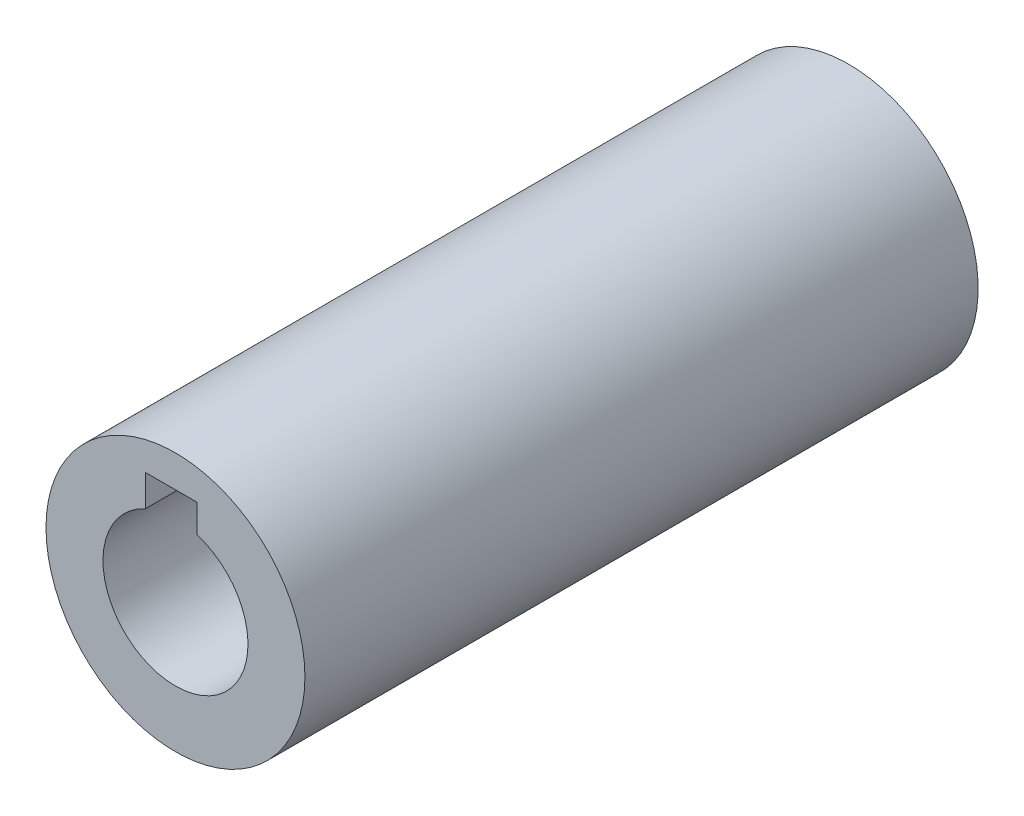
ISO-10303-21;
HEADER;
FILE_DESCRIPTION(('STEP AP214'),'2;1');
FILE_NAME('part.step','',(''),(''),'','','');
FILE_SCHEMA(('AUTOMOTIVE_DESIGN { 1 0 10303 214 1 1 1 1 }'));
ENDSEC;
DATA;
#1=APPLICATION_CONTEXT('core data for automotive mechanical design processes');
#2=APPLICATION_PROTOCOL_DEFINITION('international standard','automotive_design',2000,#1);
#3=PRODUCT_CONTEXT('',#1,'mechanical');
#4=PRODUCT('Part','Part','',(#3));
#5=PRODUCT_RELATED_PRODUCT_CATEGORY('part','',(#4));
#6=PRODUCT_DEFINITION_FORMATION('','',#4);
#7=PRODUCT_DEFINITION_CONTEXT('part definition',#1,'design');
#8=PRODUCT_DEFINITION('design','',#6,#7);
#9=PRODUCT_DEFINITION_SHAPE('','',#8);
#10=(LENGTH_UNIT() NAMED_UNIT(*) SI_UNIT(.MILLI.,.METRE.));
#11=(NAMED_UNIT(*) PLANE_ANGLE_UNIT() SI_UNIT($,.RADIAN.));
#12=(NAMED_UNIT(*) SI_UNIT($,.STERADIAN.) SOLID_ANGLE_UNIT());
#13=UNCERTAINTY_MEASURE_WITH_UNIT(LENGTH_MEASURE(1.E-05),#10,'distance_accuracy_value','');
#14=(GEOMETRIC_REPRESENTATION_CONTEXT(3) GLOBAL_UNCERTAINTY_ASSIGNED_CONTEXT((#13)) GLOBAL_UNIT_ASSIGNED_CONTEXT((#10,
#11,#12)) REPRESENTATION_CONTEXT('',''));
#15=CARTESIAN_POINT('',(0.,0.,0.));
#16=DIRECTION('',(0.,0.,1.));
#17=DIRECTION('',(1.,0.,0.));
#18=AXIS2_PLACEMENT_3D('',#15,#16,#17);
#19=CARTESIAN_POINT('',(0.,0.,30.));
#20=DIRECTION('',(0.,0.,1.));
#21=DIRECTION('',(1.,0.,0.));
#22=AXIS2_PLACEMENT_3D('',#19,#20,#21);
#23=PLANE('',#22);
#24=CARTESIAN_POINT('',(0.,0.,30.));
#25=DIRECTION('',(0.,0.,1.));
#26=DIRECTION('',(1.,0.,0.));
#27=AXIS2_PLACEMENT_3D('',#24,#25,#26);
#28=CIRCLE('',#27,12.5);
#29=CARTESIAN_POINT('',(12.5,0.,30.));
#30=VERTEX_POINT('',#29);
#31=EDGE_CURVE('E11',#30,#30,#28,.T.);
#32=ORIENTED_EDGE('',*,*,#31,.T.);
#33=EDGE_LOOP('',(#32));
#34=FACE_BOUND('',#33,.T.);
#35=DIRECTION('',(-1.,0.,0.));
#36=VECTOR('',#35,1.);
#37=CARTESIAN_POINT('',(-2.91666666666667,9.40905934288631,30.));
#38=LINE('',#37,#36);
#39=CARTESIAN_POINT('',(2.08333333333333,9.40905934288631,30.));
#40=VERTEX_POINT('',#39);
#41=CARTESIAN_POINT('',(-2.91666666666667,9.40905934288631,30.));
#42=VERTEX_POINT('',#41);
#43=EDGE_CURVE('E141',#40,#42,#38,.T.);
#44=ORIENTED_EDGE('',*,*,#43,.F.);
#45=DIRECTION('',(0.,1.,0.));
#46=VECTOR('',#45,1.);
#47=CARTESIAN_POINT('',(2.08333333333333,6.6827929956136,30.));
#48=LINE('',#47,#46);
#49=CARTESIAN_POINT('',(2.08333333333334,6.6827929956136,30.));
#50=VERTEX_POINT('',#49);
#51=EDGE_CURVE('E139',#50,#40,#48,.T.);
#52=ORIENTED_EDGE('',*,*,#51,.F.);
#53=CARTESIAN_POINT('',(0.,0.,30.));
#54=DIRECTION('',(0.,0.,1.));
#55=DIRECTION('',(1.,0.,0.));
#56=AXIS2_PLACEMENT_3D('',#53,#54,#55);
#57=CIRCLE('',#56,7.);
#58=CARTESIAN_POINT('',(-2.91666666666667,6.36341540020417,30.));
#59=VERTEX_POINT('',#58);
#60=EDGE_CURVE('E147',#59,#50,#57,.T.);
#61=ORIENTED_EDGE('',*,*,#60,.F.);
#62=DIRECTION('',(0.,-1.,0.));
#63=VECTOR('',#62,1.);
#64=CARTESIAN_POINT('',(-2.91666666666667,6.36341540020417,30.));
#65=LINE('',#64,#63);
#66=EDGE_CURVE('E144',#42,#59,#65,.T.);
#67=ORIENTED_EDGE('',*,*,#66,.F.);
#68=EDGE_LOOP('',(#44,#52,#61,#67));
#69=FACE_BOUND('',#68,.T.);
#70=ADVANCED_FACE('F34',(#34,#69),#23,.T.);
#71=CARTESIAN_POINT('',(0.,0.,30.));
#72=DIRECTION('',(0.,0.,-1.));
#73=DIRECTION('',(-1.,0.,0.));
#74=AXIS2_PLACEMENT_3D('',#71,#72,#73);
#75=CYLINDRICAL_SURFACE('',#74,12.5);
#76=ORIENTED_EDGE('',*,*,#31,.F.);
#77=EDGE_LOOP('',(#76));
#78=FACE_BOUND('',#77,.T.);
#79=CARTESIAN_POINT('',(0.,0.,-35.));
#80=DIRECTION('',(0.,0.,-1.));
#81=DIRECTION('',(-1.,0.,0.));
#82=AXIS2_PLACEMENT_3D('',#79,#80,#81);
#83=CIRCLE('',#82,12.5);
#84=CARTESIAN_POINT('',(-12.5,0.,-35.));
#85=VERTEX_POINT('',#84);
#86=EDGE_CURVE('E127',#85,#85,#83,.T.);
#87=ORIENTED_EDGE('',*,*,#86,.F.);
#88=EDGE_LOOP('',(#87));
#89=FACE_BOUND('',#88,.T.);
#90=ADVANCED_FACE('F36',(#78,#89),#75,.T.);
#91=CARTESIAN_POINT('',(2.08333333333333,6.6827929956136,30.));
#92=DIRECTION('',(-1.,0.,0.));
#93=DIRECTION('',(0.,0.,1.));
#94=AXIS2_PLACEMENT_3D('',#91,#92,#93);
#95=PLANE('',#94);
#96=DIRECTION('',(0.,1.,0.));
#97=VECTOR('',#96,1.);
#98=CARTESIAN_POINT('',(2.08333333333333,6.6827929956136,0.));
#99=LINE('',#98,#97);
#100=CARTESIAN_POINT('',(2.08333333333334,6.6827929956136,0.));
#101=VERTEX_POINT('',#100);
#102=CARTESIAN_POINT('',(2.08333333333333,9.40905934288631,0.));
#103=VERTEX_POINT('',#102);
#104=EDGE_CURVE('E106',#101,#103,#99,.T.);
#105=ORIENTED_EDGE('',*,*,#104,.F.);
#106=DIRECTION('',(0.,0.,-1.));
#107=VECTOR('',#106,1.);
#108=CARTESIAN_POINT('',(2.08333333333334,6.6827929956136,30.));
#109=LINE('',#108,#107);
#110=EDGE_CURVE('E149',#50,#101,#109,.T.);
#111=ORIENTED_EDGE('',*,*,#110,.F.);
#112=ORIENTED_EDGE('',*,*,#51,.T.);
#113=DIRECTION('',(0.,0.,-1.));
#114=VECTOR('',#113,1.);
#115=CARTESIAN_POINT('',(2.08333333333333,9.40905934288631,30.));
#116=LINE('',#115,#114);
#117=EDGE_CURVE('E42',#40,#103,#116,.T.);
#118=ORIENTED_EDGE('',*,*,#117,.T.);
#119=EDGE_LOOP('',(#105,#111,#112,#118));
#120=FACE_BOUND('',#119,.T.);
#121=ADVANCED_FACE('F168',(#120),#95,.T.);
#122=CARTESIAN_POINT('',(-2.91666666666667,9.40905934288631,30.));
#123=DIRECTION('',(0.,-1.,0.));
#124=DIRECTION('',(0.,0.,-1.));
#125=AXIS2_PLACEMENT_3D('',#122,#123,#124);
#126=PLANE('',#125);
#127=DIRECTION('',(-1.,0.,0.));
#128=VECTOR('',#127,1.);
#129=CARTESIAN_POINT('',(-2.91666666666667,9.40905934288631,0.));
#130=LINE('',#129,#128);
#131=CARTESIAN_POINT('',(-2.91666666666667,9.40905934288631,0.));
#132=VERTEX_POINT('',#131);
#133=EDGE_CURVE('E152',#103,#132,#130,.T.);
#134=ORIENTED_EDGE('',*,*,#133,.F.);
#135=ORIENTED_EDGE('',*,*,#117,.F.);
#136=ORIENTED_EDGE('',*,*,#43,.T.);
#137=DIRECTION('',(0.,0.,-1.));
#138=VECTOR('',#137,1.);
#139=CARTESIAN_POINT('',(-2.91666666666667,9.40905934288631,30.));
#140=LINE('',#139,#138);
#141=EDGE_CURVE('E163',#42,#132,#140,.T.);
#142=ORIENTED_EDGE('',*,*,#141,.T.);
#143=EDGE_LOOP('',(#134,#135,#136,#142));
#144=FACE_BOUND('',#143,.T.);
#145=ADVANCED_FACE('F183',(#144),#126,.T.);
#146=CARTESIAN_POINT('',(-2.91666666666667,6.36341540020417,30.));
#147=DIRECTION('',(1.,0.,0.));
#148=DIRECTION('',(0.,0.,-1.));
#149=AXIS2_PLACEMENT_3D('',#146,#147,#148);
#150=PLANE('',#149);
#151=DIRECTION('',(0.,-1.,0.));
#152=VECTOR('',#151,1.);
#153=CARTESIAN_POINT('',(-2.91666666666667,6.36341540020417,0.));
#154=LINE('',#153,#152);
#155=CARTESIAN_POINT('',(-2.91666666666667,6.36341540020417,0.));
#156=VERTEX_POINT('',#155);
#157=EDGE_CURVE('E155',#132,#156,#154,.T.);
#158=ORIENTED_EDGE('',*,*,#157,.F.);
#159=ORIENTED_EDGE('',*,*,#141,.F.);
#160=ORIENTED_EDGE('',*,*,#66,.T.);
#161=DIRECTION('',(0.,0.,-1.));
#162=VECTOR('',#161,1.);
#163=CARTESIAN_POINT('',(-2.91666666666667,6.36341540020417,30.));
#164=LINE('',#163,#162);
#165=EDGE_CURVE('E161',#59,#156,#164,.T.);
#166=ORIENTED_EDGE('',*,*,#165,.T.);
#167=EDGE_LOOP('',(#158,#159,#160,#166));
#168=FACE_BOUND('',#167,.T.);
#169=ADVANCED_FACE('F185',(#168),#150,.T.);
#170=CARTESIAN_POINT('',(0.,0.,30.));
#171=DIRECTION('',(0.,0.,-1.));
#172=DIRECTION('',(-1.,0.,0.));
#173=AXIS2_PLACEMENT_3D('',#170,#171,#172);
#174=CYLINDRICAL_SURFACE('',#173,7.);
#175=CARTESIAN_POINT('',(0.,0.,0.));
#176=DIRECTION('',(0.,0.,1.));
#177=DIRECTION('',(1.,0.,0.));
#178=AXIS2_PLACEMENT_3D('',#175,#176,#177);
#179=CIRCLE('',#178,7.);
#180=EDGE_CURVE('E142',#156,#101,#179,.T.);
#181=ORIENTED_EDGE('',*,*,#180,.F.);
#182=ORIENTED_EDGE('',*,*,#165,.F.);
#183=ORIENTED_EDGE('',*,*,#60,.T.);
#184=ORIENTED_EDGE('',*,*,#110,.T.);
#185=EDGE_LOOP('',(#181,#182,#183,#184));
#186=FACE_BOUND('',#185,.T.);
#187=ADVANCED_FACE('F178',(#186),#174,.F.);
#188=CARTESIAN_POINT('',(0.,0.,0.));
#189=DIRECTION('',(0.,0.,-1.));
#190=DIRECTION('',(-1.,0.,0.));
#191=AXIS2_PLACEMENT_3D('',#188,#189,#190);
#192=PLANE('',#191);
#193=ORIENTED_EDGE('',*,*,#104,.T.);
#194=ORIENTED_EDGE('',*,*,#133,.T.);
#195=ORIENTED_EDGE('',*,*,#157,.T.);
#196=ORIENTED_EDGE('',*,*,#180,.T.);
#197=EDGE_LOOP('',(#193,#194,#195,#196));
#198=FACE_BOUND('',#197,.T.);
#199=ADVANCED_FACE('F174',(#198),#192,.F.);
#200=CARTESIAN_POINT('',(0.,0.,-35.));
#201=DIRECTION('',(0.,0.,1.));
#202=DIRECTION('',(1.,0.,0.));
#203=AXIS2_PLACEMENT_3D('',#200,#201,#202);
#204=CYLINDRICAL_SURFACE('',#203,6.);
#205=CARTESIAN_POINT('',(0.,0.,-5.));
#206=DIRECTION('',(0.,0.,-1.));
#207=DIRECTION('',(-1.,0.,0.));
#208=AXIS2_PLACEMENT_3D('',#205,#206,#207);
#209=CIRCLE('',#208,6.);
#210=CARTESIAN_POINT('',(1.25,5.86834729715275,-5.));
#211=VERTEX_POINT('',#210);
#212=CARTESIAN_POINT('',(-1.25,5.86834729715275,-5.));
#213=VERTEX_POINT('',#212);
#214=EDGE_CURVE('E104',#211,#213,#209,.T.);
#215=ORIENTED_EDGE('',*,*,#214,.F.);
#216=DIRECTION('',(0.,0.,1.));
#217=VECTOR('',#216,1.);
#218=CARTESIAN_POINT('',(1.25,5.86834729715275,-35.));
#219=LINE('',#218,#217);
#220=CARTESIAN_POINT('',(1.25,5.86834729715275,-35.));
#221=VERTEX_POINT('',#220);
#222=EDGE_CURVE('E97',#221,#211,#219,.T.);
#223=ORIENTED_EDGE('',*,*,#222,.F.);
#224=CARTESIAN_POINT('',(0.,0.,-35.));
#225=DIRECTION('',(0.,0.,-1.));
#226=DIRECTION('',(-1.,0.,0.));
#227=AXIS2_PLACEMENT_3D('',#224,#225,#226);
#228=CIRCLE('',#227,6.);
#229=CARTESIAN_POINT('',(-1.25,5.86834729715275,-35.));
#230=VERTEX_POINT('',#229);
#231=EDGE_CURVE('E102',#221,#230,#228,.T.);
#232=ORIENTED_EDGE('',*,*,#231,.T.);
#233=DIRECTION('',(0.,0.,1.));
#234=VECTOR('',#233,1.);
#235=CARTESIAN_POINT('',(-1.25,5.86834729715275,-35.));
#236=LINE('',#235,#234);
#237=EDGE_CURVE('E130',#230,#213,#236,.T.);
#238=ORIENTED_EDGE('',*,*,#237,.T.);
#239=EDGE_LOOP('',(#215,#223,#232,#238));
#240=FACE_BOUND('',#239,.T.);
#241=ADVANCED_FACE('F99',(#240),#204,.F.);
#242=CARTESIAN_POINT('',(1.25,0.,-35.));
#243=DIRECTION('',(1.,0.,0.));
#244=DIRECTION('',(0.,1.,0.));
#245=AXIS2_PLACEMENT_3D('',#242,#243,#244);
#246=PLANE('',#245);
#247=DIRECTION('',(0.,1.,0.));
#248=VECTOR('',#247,1.);
#249=CARTESIAN_POINT('',(1.25,0.,-5.));
#250=LINE('',#249,#248);
#251=CARTESIAN_POINT('',(1.25,7.85568057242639,-5.));
#252=VERTEX_POINT('',#251);
#253=EDGE_CURVE('E49',#211,#252,#250,.T.);
#254=ORIENTED_EDGE('',*,*,#253,.T.);
#255=DIRECTION('',(0.,0.,1.));
#256=VECTOR('',#255,1.);
#257=CARTESIAN_POINT('',(1.25,7.85568057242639,-35.));
#258=LINE('',#257,#256);
#259=CARTESIAN_POINT('',(1.25,7.85568057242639,-35.));
#260=VERTEX_POINT('',#259);
#261=EDGE_CURVE('E107',#260,#252,#258,.T.);
#262=ORIENTED_EDGE('',*,*,#261,.F.);
#263=DIRECTION('',(0.,1.,0.));
#264=VECTOR('',#263,1.);
#265=CARTESIAN_POINT('',(1.25,0.,-35.));
#266=LINE('',#265,#264);
#267=EDGE_CURVE('E110',#221,#260,#266,.T.);
#268=ORIENTED_EDGE('',*,*,#267,.F.);
#269=ORIENTED_EDGE('',*,*,#222,.T.);
#270=EDGE_LOOP('',(#254,#262,#268,#269));
#271=FACE_BOUND('',#270,.T.);
#272=ADVANCED_FACE('F111',(#271),#246,.F.);
#273=CARTESIAN_POINT('',(0.,7.85568057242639,-35.));
#274=DIRECTION('',(0.,1.,0.));
#275=DIRECTION('',(0.,0.,1.));
#276=AXIS2_PLACEMENT_3D('',#273,#274,#275);
#277=PLANE('',#276);
#278=DIRECTION('',(-1.,0.,0.));
#279=VECTOR('',#278,1.);
#280=CARTESIAN_POINT('',(0.,7.85568057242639,-5.));
#281=LINE('',#280,#279);
#282=CARTESIAN_POINT('',(-1.25,7.85568057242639,-5.));
#283=VERTEX_POINT('',#282);
#284=EDGE_CURVE('E54',#252,#283,#281,.T.);
#285=ORIENTED_EDGE('',*,*,#284,.T.);
#286=DIRECTION('',(0.,0.,1.));
#287=VECTOR('',#286,1.);
#288=CARTESIAN_POINT('',(-1.25,7.85568057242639,-35.));
#289=LINE('',#288,#287);
#290=CARTESIAN_POINT('',(-1.25,7.85568057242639,-35.));
#291=VERTEX_POINT('',#290);
#292=EDGE_CURVE('E135',#291,#283,#289,.T.);
#293=ORIENTED_EDGE('',*,*,#292,.F.);
#294=DIRECTION('',(-1.,0.,0.));
#295=VECTOR('',#294,1.);
#296=CARTESIAN_POINT('',(0.,7.85568057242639,-35.));
#297=LINE('',#296,#295);
#298=EDGE_CURVE('E115',#260,#291,#297,.T.);
#299=ORIENTED_EDGE('',*,*,#298,.F.);
#300=ORIENTED_EDGE('',*,*,#261,.T.);
#301=EDGE_LOOP('',(#285,#293,#299,#300));
#302=FACE_BOUND('',#301,.T.);
#303=ADVANCED_FACE('F252',(#302),#277,.F.);
#304=CARTESIAN_POINT('',(-1.25000000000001,0.,-35.));
#305=DIRECTION('',(1.,0.,0.));
#306=DIRECTION('',(0.,1.,0.));
#307=AXIS2_PLACEMENT_3D('',#304,#305,#306);
#308=PLANE('',#307);
#309=DIRECTION('',(0.,1.,0.));
#310=VECTOR('',#309,1.);
#311=CARTESIAN_POINT('',(-1.25000000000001,0.,-5.));
#312=LINE('',#311,#310);
#313=EDGE_CURVE('E121',#213,#283,#312,.T.);
#314=ORIENTED_EDGE('',*,*,#313,.F.);
#315=ORIENTED_EDGE('',*,*,#237,.F.);
#316=DIRECTION('',(0.,1.,0.));
#317=VECTOR('',#316,1.);
#318=CARTESIAN_POINT('',(-1.25000000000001,0.,-35.));
#319=LINE('',#318,#317);
#320=EDGE_CURVE('E120',#230,#291,#319,.T.);
#321=ORIENTED_EDGE('',*,*,#320,.T.);
#322=ORIENTED_EDGE('',*,*,#292,.T.);
#323=EDGE_LOOP('',(#314,#315,#321,#322));
#324=FACE_BOUND('',#323,.T.);
#325=ADVANCED_FACE('F261',(#324),#308,.T.);
#326=CARTESIAN_POINT('',(0.,0.,-35.));
#327=DIRECTION('',(0.,0.,-1.));
#328=DIRECTION('',(-1.,0.,0.));
#329=AXIS2_PLACEMENT_3D('',#326,#327,#328);
#330=PLANE('',#329);
#331=ORIENTED_EDGE('',*,*,#231,.F.);
#332=ORIENTED_EDGE('',*,*,#267,.T.);
#333=ORIENTED_EDGE('',*,*,#298,.T.);
#334=ORIENTED_EDGE('',*,*,#320,.F.);
#335=EDGE_LOOP('',(#331,#332,#333,#334));
#336=FACE_BOUND('',#335,.T.);
#337=ORIENTED_EDGE('',*,*,#86,.T.);
#338=EDGE_LOOP('',(#337));
#339=FACE_BOUND('',#338,.T.);
#340=ADVANCED_FACE('F117',(#336,#339),#330,.T.);
#341=CARTESIAN_POINT('',(0.,0.,-5.));
#342=DIRECTION('',(0.,0.,-1.));
#343=DIRECTION('',(-1.,0.,0.));
#344=AXIS2_PLACEMENT_3D('',#341,#342,#343);
#345=PLANE('',#344);
#346=ORIENTED_EDGE('',*,*,#214,.T.);
#347=ORIENTED_EDGE('',*,*,#313,.T.);
#348=ORIENTED_EDGE('',*,*,#284,.F.);
#349=ORIENTED_EDGE('',*,*,#253,.F.);
#350=EDGE_LOOP('',(#346,#347,#348,#349));
#351=FACE_BOUND('',#350,.T.);
#352=ADVANCED_FACE('F280',(#351),#345,.T.);
#353=CLOSED_SHELL('',(#70,#90,#121,#145,#169,#187,#199,#241,#272,#303,#325,#340,#352));
#354=MANIFOLD_SOLID_BREP('B2',#353);
#355=ADVANCED_BREP_SHAPE_REPRESENTATION('',(#18,#354),#14);
#356=SHAPE_DEFINITION_REPRESENTATION(#9,#355);
ENDSEC;
END-ISO-10303-21;
